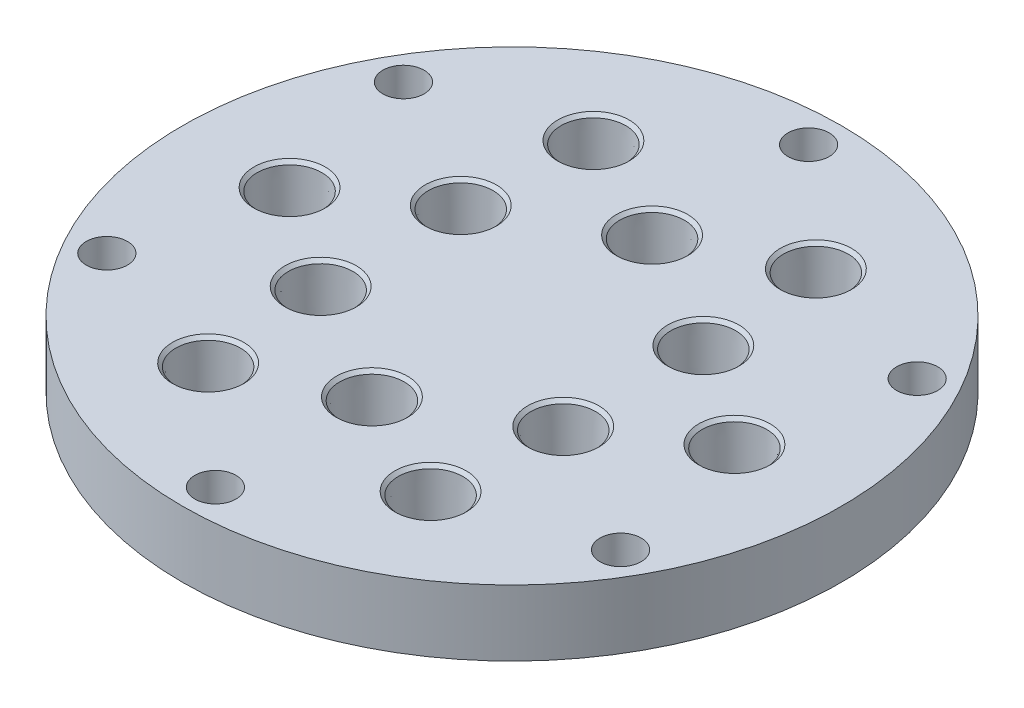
from build123d import *

# Parameters (mm, degrees)
SKETCH1_W                         = 63.5
SKETCH1_H                         = 12.7
F_5_16_0_3125_DIAMETER_HOLE1_D    = 7.9375
F_1_4_NPT_TAPPED_HOLE1_AT_2_COUNT = 2
F_1_4_NPT_TAPPED_HOLE1_AT_2_PITCH = 50.650953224
CIRPATTERN1_COUNT                 = 6


with BuildPart() as part:
    # Sketch1 → Revolve1 (revolve)
    with BuildSketch(Plane.XY, mode=Mode.PRIVATE) as revolve1_sk:
        with Locations((31.75, 6.35)):
            Rectangle(SKETCH1_W, SKETCH1_H)
    revolve(revolve1_sk.sketch.rotate(Axis((0, 0, 0), (0, -1, 0)), 90), axis=Axis((0, 0, 0), (0, -1, 0)))

    # 5_16 _0.3125_ Diameter Hole1 (through all)
    with Locations(Plane(origin=(0, 12.7, 0), x_dir=(-1, 0, 0), z_dir=(0, 1, 0))):
        with Locations((0, 57.15)):
            f_5_16_0_3125_diameter_hole1 = Hole(F_5_16_0_3125_DIAMETER_HOLE1_D / 2)

    # Sketch4 → 1_4 NPT Tapped Hole1 (revolve, cut)
    with BuildSketch(Plane(origin=(0, 12.7, 26.9875), x_dir=(0, 0, 1), z_dir=(1, 0, 0))):
        Polygon((0, 0), (0, 20.360347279), (5.5626, 17.018), (5.5626, 9.906), (5.962698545, 9.906), (6.2402847, 0.635), (6.8752847, 0), align=None)
    f_1_4_npt_tapped_hole1 = revolve(axis=Axis((0, 19.05, 26.9875), (0, -1, 0)), mode=Mode.SUBTRACT)

    # 1_4 NPT Tapped Hole1 at 2: 1_4 NPT Tapped Hole1 ×2
    with Locations(*[Vector(0.8462328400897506, 0, -0.5328132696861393) * (i * F_1_4_NPT_TAPPED_HOLE1_AT_2_PITCH) for i in range(1, F_1_4_NPT_TAPPED_HOLE1_AT_2_COUNT)]):
        add(f_1_4_npt_tapped_hole1, mode=Mode.SUBTRACT)

    # CirPattern1: 5_16 _0.3125_ Diameter Hole1, 1_4 NPT Tapped Hole1 ×6 about axis
    cirpattern1_axis = Axis((0, 0, 0), (0, 1, 0))
    add([f_5_16_0_3125_diameter_hole1.rotate(cirpattern1_axis, i * 360 / CIRPATTERN1_COUNT) for i in range(1, CIRPATTERN1_COUNT)], mode=Mode.SUBTRACT)
    add([f_1_4_npt_tapped_hole1.rotate(cirpattern1_axis, i * 360 / CIRPATTERN1_COUNT) for i in range(1, CIRPATTERN1_COUNT)], mode=Mode.SUBTRACT)

    # CirPattern1 copy 1 sketch → CirPattern1 copy 1 (revolve, cut)
    with BuildSketch(Plane(origin=(21.43125, 12.7, -37.12001387), x_dir=(0.8660254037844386, 0, 0.5000000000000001), z_dir=(0.5000000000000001, 0, -0.8660254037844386))):
        Polygon((0, 0), (0, 20.360347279), (5.5626, 17.018), (5.5626, 9.906), (5.962698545, 9.906), (6.2402847, 0.635), (6.8752847, 0), align=None)
    revolve(axis=Axis((21.43125, 19.05, -37.12001387), (0, -1, 0)), mode=Mode.SUBTRACT)

    # CirPattern1 copy 2 sketch → CirPattern1 copy 2 (revolve, cut)
    with BuildSketch(Plane(origin=(-21.43125, 12.7, -37.12001387), x_dir=(0.8660254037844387, 0, -0.4999999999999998), z_dir=(-0.4999999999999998, 0, -0.8660254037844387))):
        Polygon((0, 0), (0, 20.360347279), (5.5626, 17.018), (5.5626, 9.906), (5.962698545, 9.906), (6.2402847, 0.635), (6.8752847, 0), align=None)
    revolve(axis=Axis((-21.43125, 19.05, -37.12001387), (0, -1, 0)), mode=Mode.SUBTRACT)

    # CirPattern1 copy 3 sketch → CirPattern1 copy 3 (revolve, cut)
    with BuildSketch(Plane(origin=(-42.8625, 12.7, 0), x_dir=(0, 0, -1), z_dir=(-1, 0, 0))):
        Polygon((0, 0), (0, 20.360347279), (5.5626, 17.018), (5.5626, 9.906), (5.962698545, 9.906), (6.2402847, 0.635), (6.8752847, 0), align=None)
    revolve(axis=Axis((-42.8625, 19.05, 0), (0, -1, 0)), mode=Mode.SUBTRACT)

    # CirPattern1 copy 4 sketch → CirPattern1 copy 4 (revolve, cut)
    with BuildSketch(Plane(origin=(-21.43125, 12.7, 37.12001387), x_dir=(-0.8660254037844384, 0, -0.5000000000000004), z_dir=(-0.5000000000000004, 0, 0.8660254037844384))):
        Polygon((0, 0), (0, 20.360347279), (5.5626, 17.018), (5.5626, 9.906), (5.962698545, 9.906), (6.2402847, 0.635), (6.8752847, 0), align=None)
    revolve(axis=Axis((-21.43125, 19.05, 37.12001387), (0, -1, 0)), mode=Mode.SUBTRACT)

    # CirPattern1 copy 5 sketch → CirPattern1 copy 5 (revolve, cut)
    with BuildSketch(Plane(origin=(21.43125, 12.7, 37.12001387), x_dir=(-0.8660254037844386, 0, 0.5000000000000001), z_dir=(0.5000000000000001, 0, 0.8660254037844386))):
        Polygon((0, 0), (0, 20.360347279), (5.5626, 17.018), (5.5626, 9.906), (5.962698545, 9.906), (6.2402847, 0.635), (6.8752847, 0), align=None)
    revolve(axis=Axis((21.43125, 19.05, 37.12001387), (0, -1, 0)), mode=Mode.SUBTRACT)


solid = part.part
